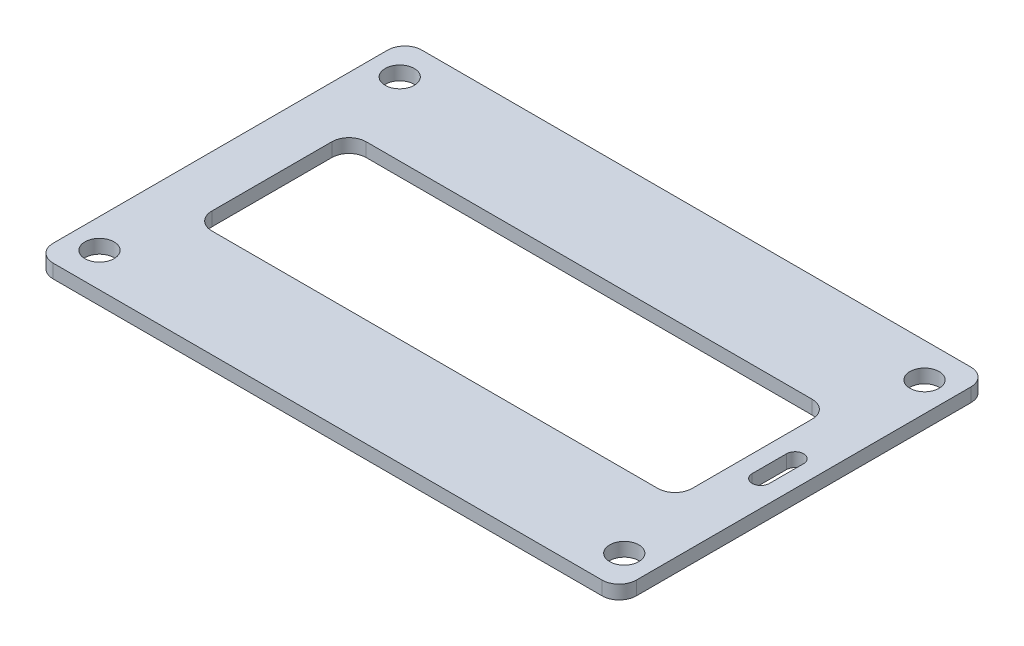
from build123d import *

# Parameters (mm, degrees)
SKETCH1_R           = 1.7
BOSS_EXTRUDE1_DEPTH = 1.6


with BuildPart() as part:
    # Sketch1 → Boss-Extrude1 (new body)
    with BuildSketch(Plane(origin=(0, 0, 0), x_dir=(1, 0, 0), z_dir=(0, 1, 0))):
        with BuildLine():
            Line((-32, -21.5), (32, -21.5))
            ThreePointArc((32, -21.5), (33.414213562, -20.914213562), (34, -19.5))
            Line((34, -19.5), (34, 19.5))
            ThreePointArc((34, 19.5), (33.414213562, 20.914213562), (32, 21.5))
            Line((32, 21.5), (-32, 21.5))
            ThreePointArc((-32, 21.5), (-33.414213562, 20.914213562), (-34, 19.5))
            Line((-34, 19.5), (-34, -19.5))
            ThreePointArc((-34, -19.5), (-33.414213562, -20.914213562), (-32, -21.5))
        make_face()
        with Locations(Location((30.588511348, 17.5, 0), (0, 0, 270))):
            Circle(SKETCH1_R, mode=Mode.SUBTRACT)
        with Locations(Location((-30.588511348, 17.5, 0), (0, 0, 270))):
            Circle(SKETCH1_R, mode=Mode.SUBTRACT)
        with Locations(Location((-30.588511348, -17.5, 0), (0, 0, 270))):
            Circle(SKETCH1_R, mode=Mode.SUBTRACT)
        with Locations(Location((30.588511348, -17.5, 0), (0, 0, 270))):
            Circle(SKETCH1_R, mode=Mode.SUBTRACT)
        with BuildLine():
            Line((28, -7), (28, 7))
            ThreePointArc((28, 7), (27.414213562, 8.414213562), (26, 9))
            Line((26, 9), (-26, 9))
            ThreePointArc((-26, 9), (-27.414213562, 8.414213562), (-28, 7))
            Line((-28, 7), (-28, -7))
            ThreePointArc((-28, -7), (-27.414213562, -8.414213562), (-26, -9))
            Line((-26, -9), (26, -9))
            ThreePointArc((26, -9), (27.414213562, -8.414213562), (28, -7))
        make_face(mode=Mode.SUBTRACT)
        with BuildLine():
            Line((30, 2), (30, -2))
            ThreePointArc((30, -2), (31, -3), (32, -2))
            Line((32, -2), (32, 2))
            ThreePointArc((32, 2), (31, 3), (30, 2))
        make_face(mode=Mode.SUBTRACT)
    extrude(amount=BOSS_EXTRUDE1_DEPTH)


solid = part.part
